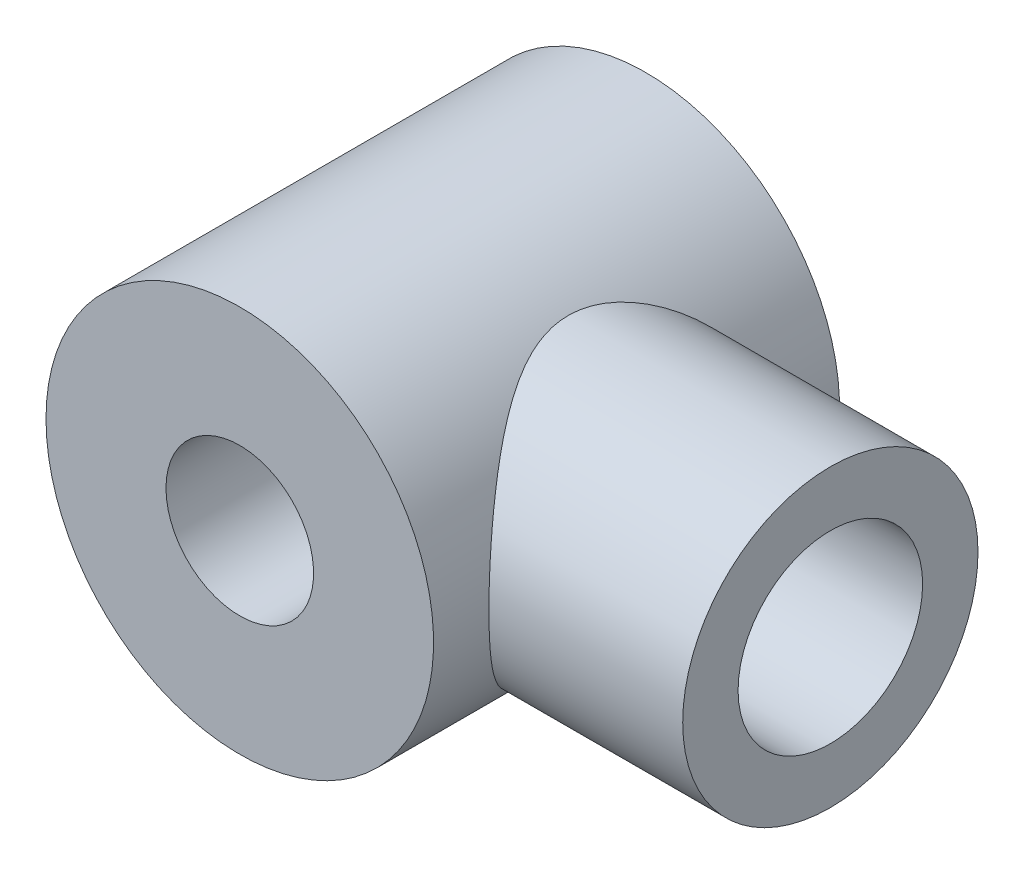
ISO-10303-21;
HEADER;
FILE_DESCRIPTION(('STEP AP214'),'2;1');
FILE_NAME('part.step','',(''),(''),'','','');
FILE_SCHEMA(('AUTOMOTIVE_DESIGN { 1 0 10303 214 1 1 1 1 }'));
ENDSEC;
DATA;
#1=APPLICATION_CONTEXT('core data for automotive mechanical design processes');
#2=APPLICATION_PROTOCOL_DEFINITION('international standard','automotive_design',2000,#1);
#3=PRODUCT_CONTEXT('',#1,'mechanical');
#4=PRODUCT('Part','Part','',(#3));
#5=PRODUCT_RELATED_PRODUCT_CATEGORY('part','',(#4));
#6=PRODUCT_DEFINITION_FORMATION('','',#4);
#7=PRODUCT_DEFINITION_CONTEXT('part definition',#1,'design');
#8=PRODUCT_DEFINITION('design','',#6,#7);
#9=PRODUCT_DEFINITION_SHAPE('','',#8);
#10=(LENGTH_UNIT() NAMED_UNIT(*) SI_UNIT(.MILLI.,.METRE.));
#11=(NAMED_UNIT(*) PLANE_ANGLE_UNIT() SI_UNIT($,.RADIAN.));
#12=(NAMED_UNIT(*) SI_UNIT($,.STERADIAN.) SOLID_ANGLE_UNIT());
#13=UNCERTAINTY_MEASURE_WITH_UNIT(LENGTH_MEASURE(1.E-05),#10,'distance_accuracy_value','');
#14=(GEOMETRIC_REPRESENTATION_CONTEXT(3) GLOBAL_UNCERTAINTY_ASSIGNED_CONTEXT((#13)) GLOBAL_UNIT_ASSIGNED_CONTEXT((#10,
#11,#12)) REPRESENTATION_CONTEXT('',''));
#15=CARTESIAN_POINT('',(0.,0.,0.));
#16=DIRECTION('',(0.,0.,1.));
#17=DIRECTION('',(1.,0.,0.));
#18=AXIS2_PLACEMENT_3D('',#15,#16,#17);
#19=CARTESIAN_POINT('',(0.,0.,22.));
#20=DIRECTION('',(0.,0.,-1.));
#21=DIRECTION('',(-1.,0.,0.));
#22=AXIS2_PLACEMENT_3D('',#19,#20,#21);
#23=CYLINDRICAL_SURFACE('',#22,4.);
#24=CARTESIAN_POINT('',(0.,0.,22.));
#25=DIRECTION('',(0.,0.,-1.));
#26=DIRECTION('',(-1.,0.,0.));
#27=AXIS2_PLACEMENT_3D('',#24,#25,#26);
#28=CIRCLE('',#27,4.);
#29=CARTESIAN_POINT('',(-4.,0.,22.));
#30=VERTEX_POINT('',#29);
#31=EDGE_CURVE('E34',#30,#30,#28,.T.);
#32=ORIENTED_EDGE('',*,*,#31,.F.);
#33=EDGE_LOOP('',(#32));
#34=FACE_BOUND('',#33,.T.);
#35=CARTESIAN_POINT('',(0.,0.,0.));
#36=DIRECTION('',(0.,0.,-1.));
#37=DIRECTION('',(-1.,0.,0.));
#38=AXIS2_PLACEMENT_3D('',#35,#36,#37);
#39=CIRCLE('',#38,4.);
#40=CARTESIAN_POINT('',(-4.,0.,0.));
#41=VERTEX_POINT('',#40);
#42=EDGE_CURVE('E159',#41,#41,#39,.T.);
#43=ORIENTED_EDGE('',*,*,#42,.T.);
#44=EDGE_LOOP('',(#43));
#45=FACE_BOUND('',#44,.T.);
#46=ADVANCED_FACE('F30',(#34,#45),#23,.F.);
#47=CARTESIAN_POINT('',(-10.689654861,-10.708117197,22.));
#48=DIRECTION('',(0.,0.,1.));
#49=DIRECTION('',(1.,0.,0.));
#50=AXIS2_PLACEMENT_3D('',#47,#48,#49);
#51=PLANE('',#50);
#52=ORIENTED_EDGE('',*,*,#31,.T.);
#53=EDGE_LOOP('',(#52));
#54=FACE_BOUND('',#53,.T.);
#55=CARTESIAN_POINT('',(0.,0.,22.));
#56=DIRECTION('',(0.,0.,-1.));
#57=DIRECTION('',(-1.,0.,0.));
#58=AXIS2_PLACEMENT_3D('',#55,#56,#57);
#59=CIRCLE('',#58,10.5);
#60=CARTESIAN_POINT('',(-10.5,0.,22.));
#61=VERTEX_POINT('',#60);
#62=EDGE_CURVE('E160',#61,#61,#59,.T.);
#63=ORIENTED_EDGE('',*,*,#62,.F.);
#64=EDGE_LOOP('',(#63));
#65=FACE_BOUND('',#64,.T.);
#66=ADVANCED_FACE('F71',(#54,#65),#51,.T.);
#67=CARTESIAN_POINT('',(-10.689654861,-10.708117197,0.));
#68=DIRECTION('',(0.,0.,1.));
#69=DIRECTION('',(1.,0.,0.));
#70=AXIS2_PLACEMENT_3D('',#67,#68,#69);
#71=PLANE('',#70);
#72=ORIENTED_EDGE('',*,*,#42,.F.);
#73=EDGE_LOOP('',(#72));
#74=FACE_BOUND('',#73,.T.);
#75=CARTESIAN_POINT('',(0.,0.,0.));
#76=DIRECTION('',(0.,0.,-1.));
#77=DIRECTION('',(-1.,0.,0.));
#78=AXIS2_PLACEMENT_3D('',#75,#76,#77);
#79=CIRCLE('',#78,10.5);
#80=CARTESIAN_POINT('',(-10.5,0.,0.));
#81=VERTEX_POINT('',#80);
#82=EDGE_CURVE('E56',#81,#81,#79,.F.);
#83=ORIENTED_EDGE('',*,*,#82,.F.);
#84=EDGE_LOOP('',(#83));
#85=FACE_BOUND('',#84,.T.);
#86=ADVANCED_FACE('F74',(#74,#85),#71,.F.);
#87=CARTESIAN_POINT('',(0.,0.,22.));
#88=DIRECTION('',(0.,0.,-1.));
#89=DIRECTION('',(-1.,0.,0.));
#90=AXIS2_PLACEMENT_3D('',#87,#88,#89);
#91=CYLINDRICAL_SURFACE('',#90,10.5);
#92=CARTESIAN_POINT('',(10.4999999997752,-3.45257235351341E-09,3.00000000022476));
#93=CARTESIAN_POINT('',(10.4999988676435,0.194806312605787,3.00000118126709));
#94=CARTESIAN_POINT('',(10.4945666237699,0.389631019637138,3.00712723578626));
#95=CARTESIAN_POINT('',(10.4729662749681,0.77765820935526,3.03550970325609));
#96=CARTESIAN_POINT('',(10.4567967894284,0.970860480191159,3.0567679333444));
#97=CARTESIAN_POINT('',(10.414093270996,1.35420901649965,3.11306934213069));
#98=CARTESIAN_POINT('',(10.3875523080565,1.54435314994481,3.14812173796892));
#99=CARTESIAN_POINT('',(10.324711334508,1.92005658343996,3.23144724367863));
#100=CARTESIAN_POINT('',(10.2884114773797,2.10561595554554,3.27972014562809));
#101=CARTESIAN_POINT('',(10.2070635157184,2.46991744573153,3.38846667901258));
#102=CARTESIAN_POINT('',(10.1620671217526,2.64869273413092,3.44886827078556));
#103=CARTESIAN_POINT('',(10.0640518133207,2.99967984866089,3.58129915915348));
#104=CARTESIAN_POINT('',(10.0110297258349,3.17188904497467,3.65333305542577));
#105=CARTESIAN_POINT('',(9.89794868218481,3.50887279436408,3.80818623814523));
#106=CARTESIAN_POINT('',(9.83789278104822,3.67365053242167,3.89100084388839));
#107=CARTESIAN_POINT('',(9.71168598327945,3.99537614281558,4.06670483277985));
#108=CARTESIAN_POINT('',(9.645532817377,4.15232106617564,4.15959796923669));
#109=CARTESIAN_POINT('',(9.50175872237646,4.47214811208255,4.3637995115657));
#110=CARTESIAN_POINT('',(9.42364337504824,4.6342270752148,4.47601700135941));
#111=CARTESIAN_POINT('',(9.26264074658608,4.94819358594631,4.7108173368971));
#112=CARTESIAN_POINT('',(9.17975283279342,5.10007977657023,4.83340155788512));
#113=CARTESIAN_POINT('',(9.01040597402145,5.39363846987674,5.0884414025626));
#114=CARTESIAN_POINT('',(8.92394210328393,5.53529609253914,5.22091085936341));
#115=CARTESIAN_POINT('',(8.74893416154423,5.80795937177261,5.49500497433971));
#116=CARTESIAN_POINT('',(8.66039064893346,5.93896784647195,5.63662719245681));
#117=CARTESIAN_POINT('',(8.46394653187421,6.21661160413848,5.95935794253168));
#118=CARTESIAN_POINT('',(8.35588249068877,6.36075815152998,6.14251666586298));
#119=CARTESIAN_POINT('',(8.14145180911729,6.63300808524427,6.52142211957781));
#120=CARTESIAN_POINT('',(8.03508570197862,6.76110651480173,6.7171727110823));
#121=CARTESIAN_POINT('',(7.82733283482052,7.00056773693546,7.1209450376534));
#122=CARTESIAN_POINT('',(7.72594170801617,7.11194538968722,7.32895564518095));
#123=CARTESIAN_POINT('',(7.53189880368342,7.31713299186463,7.75716722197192));
#124=CARTESIAN_POINT('',(7.43924204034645,7.41095299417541,7.97736112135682));
#125=CARTESIAN_POINT('',(7.24143359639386,7.60500686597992,8.4976028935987));
#126=CARTESIAN_POINT('',(7.1407737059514,7.69883555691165,8.80190879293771));
#127=CARTESIAN_POINT('',(7.01539135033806,7.81264892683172,9.27129028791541));
#128=CARTESIAN_POINT('',(6.97787974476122,7.84608663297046,9.42980720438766));
#129=CARTESIAN_POINT('',(6.91278456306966,7.90349892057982,9.75051995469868));
#130=CARTESIAN_POINT('',(6.88519577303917,7.92747847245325,9.91271380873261));
#131=CARTESIAN_POINT('',(6.84094537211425,7.96569772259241,10.2414927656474));
#132=CARTESIAN_POINT('',(6.82440124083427,7.97983277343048,10.4081060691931));
#133=CARTESIAN_POINT('',(6.8035550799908,7.99761403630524,10.7426628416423));
#134=CARTESIAN_POINT('',(6.79925259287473,8.0012606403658,10.9106062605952));
#135=CARTESIAN_POINT('',(6.80312261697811,7.99797023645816,11.2462737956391));
#136=CARTESIAN_POINT('',(6.81129753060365,7.99103119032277,11.4139978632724));
#137=CARTESIAN_POINT('',(6.83968864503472,7.96674360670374,11.7476490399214));
#138=CARTESIAN_POINT('',(6.85990490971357,7.94939501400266,11.9135761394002));
#139=CARTESIAN_POINT('',(6.90831382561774,7.90734401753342,12.2228252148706));
#140=CARTESIAN_POINT('',(6.93527753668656,7.88375652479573,12.366496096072));
#141=CARTESIAN_POINT('',(6.99684201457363,7.82916951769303,12.6507800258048));
#142=CARTESIAN_POINT('',(7.03144549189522,7.79816737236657,12.7913919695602));
#143=CARTESIAN_POINT('',(7.14520603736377,7.6945780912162,13.2080173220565));
#144=CARTESIAN_POINT('',(7.23430547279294,7.61141452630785,13.4787744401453));
#145=CARTESIAN_POINT('',(7.41318966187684,7.43689034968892,13.9573018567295));
#146=CARTESIAN_POINT('',(7.50005202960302,7.34959735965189,14.1677283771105));
#147=CARTESIAN_POINT('',(7.682149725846,7.15904661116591,14.5775848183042));
#148=CARTESIAN_POINT('',(7.7773895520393,7.05578025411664,14.7770087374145));
#149=CARTESIAN_POINT('',(7.9730546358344,6.8339104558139,15.16506229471));
#150=CARTESIAN_POINT('',(8.07349043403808,6.71527504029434,15.3536682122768));
#151=CARTESIAN_POINT('',(8.27652781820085,6.46337827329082,15.7195394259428));
#152=CARTESIAN_POINT('',(8.37912904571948,6.33011932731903,15.8968065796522));
#153=CARTESIAN_POINT('',(8.58711686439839,6.04511911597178,16.2448657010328));
#154=CARTESIAN_POINT('',(8.69249579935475,5.89294686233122,16.4153096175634));
#155=CARTESIAN_POINT('',(8.90059704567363,5.57366048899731,16.743405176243));
#156=CARTESIAN_POINT('',(9.00331907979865,5.40654481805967,16.9010554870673));
#157=CARTESIAN_POINT('',(9.20369161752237,5.05790746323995,17.2024662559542));
#158=CARTESIAN_POINT('',(9.301349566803,4.87640798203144,17.3462473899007));
#159=CARTESIAN_POINT('',(9.48956000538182,4.49918359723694,17.6190247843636));
#160=CARTESIAN_POINT('',(9.58011424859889,4.30346222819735,17.7480246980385));
#161=CARTESIAN_POINT('',(9.73566167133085,3.93683716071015,17.9669111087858));
#162=CARTESIAN_POINT('',(9.80224609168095,3.7682631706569,18.0595763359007));
#163=CARTESIAN_POINT('',(9.92818396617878,3.42271240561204,18.2334244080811));
#164=CARTESIAN_POINT('',(9.98753881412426,3.24573725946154,18.314609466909));
#165=CARTESIAN_POINT('',(10.0978541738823,2.88426996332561,18.4645316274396));
#166=CARTESIAN_POINT('',(10.1488229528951,2.69978544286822,18.5332809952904));
#167=CARTESIAN_POINT('',(10.2413806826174,2.324116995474,18.6575189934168));
#168=CARTESIAN_POINT('',(10.2829711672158,2.13293417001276,18.7130097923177));
#169=CARTESIAN_POINT('',(10.3488450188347,1.78236763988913,18.800593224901));
#170=CARTESIAN_POINT('',(10.3749181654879,1.62392641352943,18.8351327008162));
#171=CARTESIAN_POINT('',(10.4199299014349,1.30426310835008,18.8946386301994));
#172=CARTESIAN_POINT('',(10.4388693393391,1.14304136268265,18.9196062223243));
#173=CARTESIAN_POINT('',(10.4693054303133,0.818648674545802,18.9596812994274));
#174=CARTESIAN_POINT('',(10.4808008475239,0.655477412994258,18.9747871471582));
#175=CARTESIAN_POINT('',(10.4961475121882,0.328208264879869,18.994945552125));
#176=CARTESIAN_POINT('',(10.5000009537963,0.164110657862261,19.0000009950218));
#177=CARTESIAN_POINT('',(10.4999988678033,-0.194806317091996,18.9999988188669));
#178=CARTESIAN_POINT('',(10.4945666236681,-0.389631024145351,18.9928727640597));
#179=CARTESIAN_POINT('',(10.4729662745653,-0.777658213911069,18.9644902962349));
#180=CARTESIAN_POINT('',(10.4567967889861,-0.970860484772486,18.943232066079));
#181=CARTESIAN_POINT('',(10.4140932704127,-1.35420902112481,18.8869306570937));
#182=CARTESIAN_POINT('',(10.3875523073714,-1.54435315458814,18.8518782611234));
#183=CARTESIAN_POINT('',(10.3247113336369,-1.92005658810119,18.7685527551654));
#184=CARTESIAN_POINT('',(10.2884114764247,-2.10561596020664,18.7202798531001));
#185=CARTESIAN_POINT('',(10.2070635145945,-2.46991745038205,18.6115333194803));
#186=CARTESIAN_POINT('',(10.1620671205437,-2.64869273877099,18.5511317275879));
#187=CARTESIAN_POINT('',(10.0640518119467,-2.99967985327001,18.4187008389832));
#188=CARTESIAN_POINT('',(10.011029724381,-3.17188904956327,18.3466669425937));
#189=CARTESIAN_POINT('',(9.89794868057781,-3.50887279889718,18.1918137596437));
#190=CARTESIAN_POINT('',(9.83789277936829,-3.67365053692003,18.1089991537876));
#191=CARTESIAN_POINT('',(9.71168598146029,-3.99537614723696,17.9332951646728));
#192=CARTESIAN_POINT('',(9.64553281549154,-4.15232107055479,17.8404020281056));
#193=CARTESIAN_POINT('',(9.50175872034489,-4.47214811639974,17.6362004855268));
#194=CARTESIAN_POINT('',(9.42364337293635,-4.63422707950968,17.5239829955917));
#195=CARTESIAN_POINT('',(9.26264074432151,-4.94819359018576,17.2891826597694));
#196=CARTESIAN_POINT('',(9.17975283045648,-5.10007978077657,17.1665984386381));
#197=CARTESIAN_POINT('',(9.01040597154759,-5.3936384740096,16.9115585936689));
#198=CARTESIAN_POINT('',(8.92394210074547,-5.53529609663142,16.7790891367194));
#199=CARTESIAN_POINT('',(8.74893415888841,-5.80795937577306,16.5049950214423));
#200=CARTESIAN_POINT('',(8.66039064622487,-5.93896785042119,16.363372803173));
#201=CARTESIAN_POINT('',(8.46394652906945,-6.21661160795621,16.040642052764));
#202=CARTESIAN_POINT('',(8.35588248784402,-6.36075815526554,15.8574833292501));
#203=CARTESIAN_POINT('',(8.14145180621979,-6.63300808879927,15.4785778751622));
#204=CARTESIAN_POINT('',(8.03508569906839,-6.76110651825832,15.2828272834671));
#205=CARTESIAN_POINT('',(7.82733283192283,-7.00056774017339,14.8790549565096));
#206=CARTESIAN_POINT('',(7.72594170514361,-7.11194539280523,14.6710443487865));
#207=CARTESIAN_POINT('',(7.53189880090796,-7.31713299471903,14.2428327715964));
#208=CARTESIAN_POINT('',(7.4392420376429,-7.41095299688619,14.022638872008));
#209=CARTESIAN_POINT('',(7.24143359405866,-7.60500686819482,13.502397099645));
#210=CARTESIAN_POINT('',(7.14077370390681,-7.69883555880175,13.1980912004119));
#211=CARTESIAN_POINT('',(7.01539134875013,-7.812648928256,12.7287097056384));
#212=CARTESIAN_POINT('',(6.97787974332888,-7.84608663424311,12.5701927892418));
#213=CARTESIAN_POINT('',(6.91278456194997,-7.90349892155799,12.2494800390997));
#214=CARTESIAN_POINT('',(6.88519577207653,-7.92747847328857,12.0872861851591));
#215=CARTESIAN_POINT('',(6.84094537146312,-7.96569772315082,11.7585072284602));
#216=CARTESIAN_POINT('',(6.82440124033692,-7.97983277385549,11.5918939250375));
#217=CARTESIAN_POINT('',(6.80355507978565,-7.99761403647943,11.2573371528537));
#218=CARTESIAN_POINT('',(6.799252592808,-8.00126064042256,11.0893937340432));
#219=CARTESIAN_POINT('',(6.80312261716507,-7.99797023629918,10.7537261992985));
#220=CARTESIAN_POINT('',(6.81129753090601,-7.99103119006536,10.5860021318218));
#221=CARTESIAN_POINT('',(6.83968864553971,-7.9667436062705,10.2523509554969));
#222=CARTESIAN_POINT('',(6.85990491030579,-7.94939501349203,10.0864238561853));
#223=CARTESIAN_POINT('',(6.90831382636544,-7.90734401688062,9.77717478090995));
#224=CARTESIAN_POINT('',(6.93527753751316,-7.88375652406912,9.63350389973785));
#225=CARTESIAN_POINT('',(6.99684201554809,-7.82916951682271,9.34921997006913));
#226=CARTESIAN_POINT('',(7.03144549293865,-7.79816737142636,9.20860802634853));
#227=CARTESIAN_POINT('',(7.14520603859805,-7.69457809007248,8.7919826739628));
#228=CARTESIAN_POINT('',(7.23430547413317,-7.61141452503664,8.52122555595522));
#229=CARTESIAN_POINT('',(7.41318966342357,-7.43689034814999,8.04269813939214));
#230=CARTESIAN_POINT('',(7.50005203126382,-7.34959735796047,7.83227161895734));
#231=CARTESIAN_POINT('',(7.68214972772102,-7.15904660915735,7.42241517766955));
#232=CARTESIAN_POINT('',(7.77738955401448,-7.05578025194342,7.22299125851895));
#233=CARTESIAN_POINT('',(7.97305463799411,-6.83391045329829,6.83493770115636));
#234=CARTESIAN_POINT('',(8.07349043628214,-6.71527503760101,6.64633178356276));
#235=CARTESIAN_POINT('',(8.27652782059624,-6.46337827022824,6.2804605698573));
#236=CARTESIAN_POINT('',(8.37912904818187,-6.33011932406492,6.10319341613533));
#237=CARTESIAN_POINT('',(8.58711686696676,-6.04511911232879,5.75513429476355));
#238=CARTESIAN_POINT('',(8.69249580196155,-5.89294685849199,5.58469037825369));
#239=CARTESIAN_POINT('',(8.90059704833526,-5.57366048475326,5.25659481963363));
#240=CARTESIAN_POINT('',(9.00331908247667,-5.40654481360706,5.09894450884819));
#241=CARTESIAN_POINT('',(9.20369162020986,-5.05790745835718,4.79753374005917));
#242=CARTESIAN_POINT('',(9.30134956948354,-4.87640797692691,4.65375260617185));
#243=CARTESIAN_POINT('',(9.48956000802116,-4.49918359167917,4.38097521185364));
#244=CARTESIAN_POINT('',(9.58011425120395,-4.3034622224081,4.2519752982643));
#245=CARTESIAN_POINT('',(9.73566167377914,-3.93683715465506,4.03308888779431));
#246=CARTESIAN_POINT('',(9.80224609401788,-3.76826316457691,3.94042366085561));
#247=CARTESIAN_POINT('',(9.92818396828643,-3.4227123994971,3.76657558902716));
#248=CARTESIAN_POINT('',(9.987538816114,-3.24573725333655,3.68539053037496));
#249=CARTESIAN_POINT('',(10.0978541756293,-2.88426995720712,3.5354683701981));
#250=CARTESIAN_POINT('',(10.1488229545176,-2.69978543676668,3.46671900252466));
#251=CARTESIAN_POINT('',(10.2413806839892,-2.32411698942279,3.34248100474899));
#252=CARTESIAN_POINT('',(10.2829711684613,-2.13293416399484,3.28699020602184));
#253=CARTESIAN_POINT('',(10.3488450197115,-1.78236763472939,3.19940677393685));
#254=CARTESIAN_POINT('',(10.3749181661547,-1.62392640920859,3.16486729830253));
#255=CARTESIAN_POINT('',(10.419929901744,-1.30426310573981,3.10536136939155));
#256=CARTESIAN_POINT('',(10.4388693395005,-1.143041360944,3.08039377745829));
#257=CARTESIAN_POINT('',(10.4693054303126,-0.818648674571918,3.04031870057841));
#258=CARTESIAN_POINT('',(10.4808008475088,-0.655477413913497,3.02521285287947));
#259=CARTESIAN_POINT('',(10.4961475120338,-0.328208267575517,3.00505444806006));
#260=CARTESIAN_POINT('',(10.5000009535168,-0.164110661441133,2.99999900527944));
#261=CARTESIAN_POINT('',(10.4999999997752,-3.45257235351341E-09,3.00000000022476));
#262=B_SPLINE_CURVE_WITH_KNOTS('',3,(#92,#93,#94,#95,#96,#97,#98,#99,#100,#101,#102,#103,#104,
#105,#106,#107,#108,#109,#110,#111,#112,#113,#114,#115,#116,#117,#118,#119,#120,#121,#122,#123,
#124,#125,#126,#127,#128,#129,#130,#131,#132,#133,#134,#135,#136,#137,#138,#139,#140,#141,#142,
#143,#144,#145,#146,#147,#148,#149,#150,#151,#152,#153,#154,#155,#156,#157,#158,#159,#160,#161,
#162,#163,#164,#165,#166,#167,#168,#169,#170,#171,#172,#173,#174,#175,#176,#177,#178,#179,#180,
#181,#182,#183,#184,#185,#186,#187,#188,#189,#190,#191,#192,#193,#194,#195,#196,#197,#198,#199,
#200,#201,#202,#203,#204,#205,#206,#207,#208,#209,#210,#211,#212,#213,#214,#215,#216,#217,#218,
#219,#220,#221,#222,#223,#224,#225,#226,#227,#228,#229,#230,#231,#232,#233,#234,#235,#236,#237,
#238,#239,#240,#241,#242,#243,#244,#245,#246,#247,#248,#249,#250,#251,#252,#253,#254,#255,#256,
#257,#258,#259,#260,#261),.UNSPECIFIED.,.T.,.F.,(4,2,2,2,2,2,2,2,2,2,2,2,2,2,2,2,2,2,2,2,2,2,2,
2,2,2,2,2,2,2,2,2,2,2,2,2,2,2,2,2,2,2,2,2,2,2,2,2,2,2,2,2,2,2,2,2,2,2,2,2,2,2,2,2,2,2,2,2,2,2,2,
2,2,2,2,2,2,2,2,2,2,2,2,2,4),(0.,0.58424688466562,1.16856890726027,1.75328203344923,
2.33798596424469,2.91931458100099,3.50087363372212,4.08218102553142,4.66370564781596,
5.29925957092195,5.93489793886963,6.57144311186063,7.20781928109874,7.97771955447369,
8.74785704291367,9.51730598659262,10.2863130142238,11.2842497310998,11.7826301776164,
12.2807483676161,12.7840839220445,13.2874006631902,13.7908143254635,14.2942306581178,
14.7379978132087,15.1819226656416,16.0699117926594,16.8004601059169,17.5314030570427,
18.2638918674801,18.9962603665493,19.7503531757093,20.5045243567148,21.2575532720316,
22.0103956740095,22.6205095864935,23.2305056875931,23.8398967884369,24.4491881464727,
24.9414934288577,25.4337401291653,25.9260685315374,26.418255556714,27.0025024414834,
27.5868244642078,28.1715375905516,28.7562415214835,29.3375701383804,29.9191291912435,
30.5004365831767,31.0819612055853,31.7175151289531,32.3531534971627,32.9896986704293,
33.6260748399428,34.3959751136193,35.1661126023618,35.9355615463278,36.7045685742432,
37.7025052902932,38.2008857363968,38.699003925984,39.2023394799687,39.705656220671,
40.2090698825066,40.7124862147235,41.156253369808,41.6001782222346,42.4881673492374,
43.2187156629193,43.94965861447,44.6821474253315,45.4145159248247,46.1686087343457,
46.922779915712,47.6758088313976,48.4286512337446,49.0387651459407,49.6487612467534,
50.2581523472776,50.8674437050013,51.3597489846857,51.8519956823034,52.3443240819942,
52.8365111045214),.UNSPECIFIED.);
#263=CARTESIAN_POINT('',(10.4999999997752,-3.45257235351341E-09,3.00000000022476));
#264=VERTEX_POINT('',#263);
#265=EDGE_CURVE('E48',#264,#264,#262,.T.);
#266=ORIENTED_EDGE('',*,*,#265,.F.);
#267=EDGE_LOOP('',(#266));
#268=FACE_BOUND('',#267,.T.);
#269=ORIENTED_EDGE('',*,*,#82,.T.);
#270=EDGE_LOOP('',(#269));
#271=FACE_BOUND('',#270,.T.);
#272=ORIENTED_EDGE('',*,*,#62,.T.);
#273=EDGE_LOOP('',(#272));
#274=FACE_BOUND('',#273,.T.);
#275=ADVANCED_FACE('F58',(#268,#271,#274),#91,.T.);
#276=CARTESIAN_POINT('',(21.,0.,11.));
#277=DIRECTION('',(-1.,0.,0.));
#278=DIRECTION('',(0.,0.,1.));
#279=AXIS2_PLACEMENT_3D('',#276,#277,#278);
#280=CYLINDRICAL_SURFACE('',#279,8.);
#281=ORIENTED_EDGE('',*,*,#265,.T.);
#282=EDGE_LOOP('',(#281));
#283=FACE_BOUND('',#282,.T.);
#284=CARTESIAN_POINT('',(21.,0.,11.));
#285=DIRECTION('',(-1.,0.,0.));
#286=DIRECTION('',(0.,0.,1.));
#287=AXIS2_PLACEMENT_3D('',#284,#285,#286);
#288=CIRCLE('',#287,8.);
#289=CARTESIAN_POINT('',(21.,0.,19.));
#290=VERTEX_POINT('',#289);
#291=EDGE_CURVE('E43',#290,#290,#288,.F.);
#292=ORIENTED_EDGE('',*,*,#291,.F.);
#293=EDGE_LOOP('',(#292));
#294=FACE_BOUND('',#293,.T.);
#295=ADVANCED_FACE('F61',(#283,#294),#280,.T.);
#296=CARTESIAN_POINT('',(21.,-8.158565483,19.144498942));
#297=DIRECTION('',(1.,0.,0.));
#298=DIRECTION('',(0.,0.,-1.));
#299=AXIS2_PLACEMENT_3D('',#296,#297,#298);
#300=PLANE('',#299);
#301=CARTESIAN_POINT('',(21.,0.,11.));
#302=DIRECTION('',(1.,0.,0.));
#303=DIRECTION('',(0.,0.,-1.));
#304=AXIS2_PLACEMENT_3D('',#301,#302,#303);
#305=CIRCLE('',#304,5.);
#306=CARTESIAN_POINT('',(21.,0.,6.));
#307=VERTEX_POINT('',#306);
#308=EDGE_CURVE('E38',#307,#307,#305,.F.);
#309=ORIENTED_EDGE('',*,*,#308,.T.);
#310=EDGE_LOOP('',(#309));
#311=FACE_BOUND('',#310,.T.);
#312=ORIENTED_EDGE('',*,*,#291,.T.);
#313=EDGE_LOOP('',(#312));
#314=FACE_BOUND('',#313,.T.);
#315=ADVANCED_FACE('F65',(#311,#314),#300,.T.);
#316=CARTESIAN_POINT('',(11.,-5.099103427,16.090311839));
#317=DIRECTION('',(1.,0.,0.));
#318=DIRECTION('',(0.,0.,-1.));
#319=AXIS2_PLACEMENT_3D('',#316,#317,#318);
#320=PLANE('',#319);
#321=CARTESIAN_POINT('',(11.,0.,11.));
#322=DIRECTION('',(1.,0.,0.));
#323=DIRECTION('',(0.,0.,-1.));
#324=AXIS2_PLACEMENT_3D('',#321,#322,#323);
#325=CIRCLE('',#324,5.);
#326=CARTESIAN_POINT('',(11.,0.,6.));
#327=VERTEX_POINT('',#326);
#328=EDGE_CURVE('E10',#327,#327,#325,.T.);
#329=ORIENTED_EDGE('',*,*,#328,.T.);
#330=EDGE_LOOP('',(#329));
#331=FACE_BOUND('',#330,.T.);
#332=ADVANCED_FACE('F32',(#331),#320,.T.);
#333=CARTESIAN_POINT('',(11.,0.,11.));
#334=DIRECTION('',(1.,0.,0.));
#335=DIRECTION('',(0.,0.,-1.));
#336=AXIS2_PLACEMENT_3D('',#333,#334,#335);
#337=CYLINDRICAL_SURFACE('',#336,5.);
#338=ORIENTED_EDGE('',*,*,#308,.F.);
#339=EDGE_LOOP('',(#338));
#340=FACE_BOUND('',#339,.T.);
#341=ORIENTED_EDGE('',*,*,#328,.F.);
#342=EDGE_LOOP('',(#341));
#343=FACE_BOUND('',#342,.T.);
#344=ADVANCED_FACE('F67',(#340,#343),#337,.F.);
#345=CLOSED_SHELL('',(#46,#66,#86,#275,#295,#315,#332,#344));
#346=MANIFOLD_SOLID_BREP('B2',#345);
#347=ADVANCED_BREP_SHAPE_REPRESENTATION('',(#18,#346),#14);
#348=SHAPE_DEFINITION_REPRESENTATION(#9,#347);
ENDSEC;
END-ISO-10303-21;
